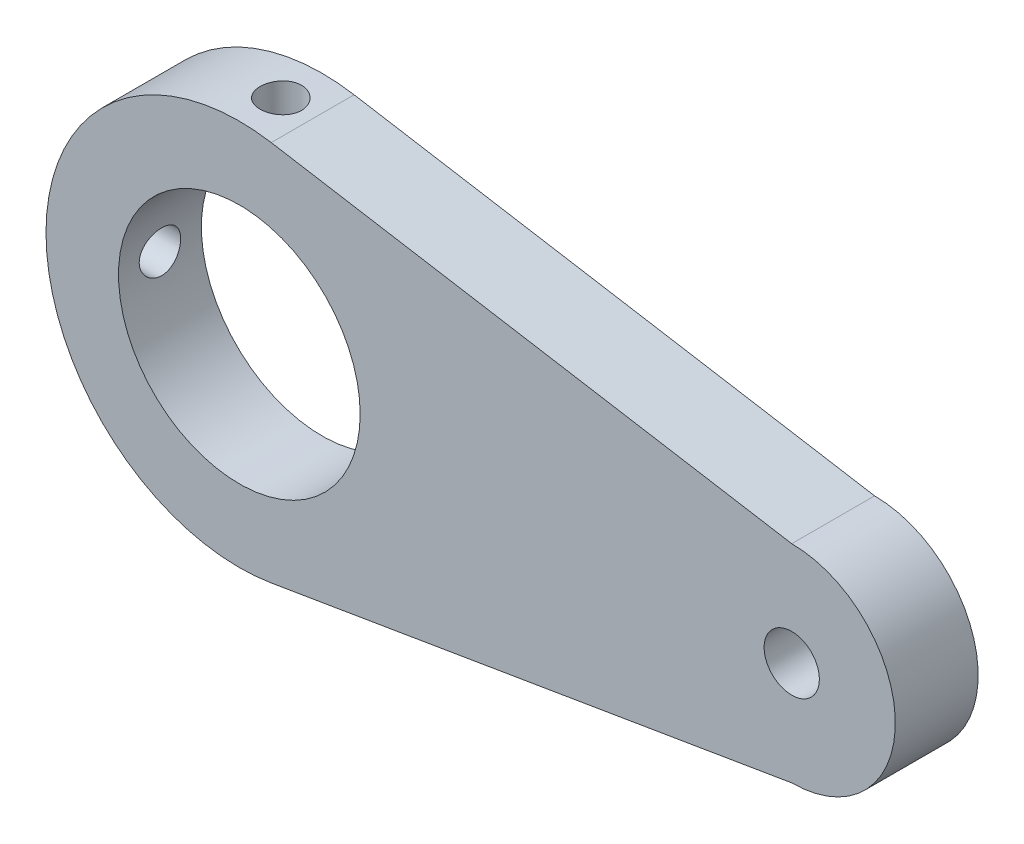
ISO-10303-21;
HEADER;
FILE_DESCRIPTION(('STEP AP214'),'2;1');
FILE_NAME('part.step','',(''),(''),'','','');
FILE_SCHEMA(('AUTOMOTIVE_DESIGN { 1 0 10303 214 1 1 1 1 }'));
ENDSEC;
DATA;
#1=APPLICATION_CONTEXT('core data for automotive mechanical design processes');
#2=APPLICATION_PROTOCOL_DEFINITION('international standard','automotive_design',2000,#1);
#3=PRODUCT_CONTEXT('',#1,'mechanical');
#4=PRODUCT('Part','Part','',(#3));
#5=PRODUCT_RELATED_PRODUCT_CATEGORY('part','',(#4));
#6=PRODUCT_DEFINITION_FORMATION('','',#4);
#7=PRODUCT_DEFINITION_CONTEXT('part definition',#1,'design');
#8=PRODUCT_DEFINITION('design','',#6,#7);
#9=PRODUCT_DEFINITION_SHAPE('','',#8);
#10=(LENGTH_UNIT() NAMED_UNIT(*) SI_UNIT(.MILLI.,.METRE.));
#11=(NAMED_UNIT(*) PLANE_ANGLE_UNIT() SI_UNIT($,.RADIAN.));
#12=(NAMED_UNIT(*) SI_UNIT($,.STERADIAN.) SOLID_ANGLE_UNIT());
#13=UNCERTAINTY_MEASURE_WITH_UNIT(LENGTH_MEASURE(1.E-05),#10,'distance_accuracy_value','');
#14=(GEOMETRIC_REPRESENTATION_CONTEXT(3) GLOBAL_UNCERTAINTY_ASSIGNED_CONTEXT((#13)) GLOBAL_UNIT_ASSIGNED_CONTEXT((#10,
#11,#12)) REPRESENTATION_CONTEXT('',''));
#15=CARTESIAN_POINT('',(0.,0.,0.));
#16=DIRECTION('',(0.,0.,1.));
#17=DIRECTION('',(1.,0.,0.));
#18=AXIS2_PLACEMENT_3D('',#15,#16,#17);
#19=CARTESIAN_POINT('',(0.,0.,12.));
#20=DIRECTION('',(0.,0.,-1.));
#21=DIRECTION('',(-1.,0.,0.));
#22=AXIS2_PLACEMENT_3D('',#19,#20,#21);
#23=CYLINDRICAL_SURFACE('',#22,28.);
#24=CARTESIAN_POINT('',(0.,28.,9.));
#25=CARTESIAN_POINT('',(-0.167994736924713,27.9999979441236,8.99999275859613));
#26=CARTESIAN_POINT('',(-0.336098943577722,27.9984720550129,8.98584135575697));
#27=CARTESIAN_POINT('',(-0.667642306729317,27.9925317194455,8.92960483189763));
#28=CARTESIAN_POINT('',(-0.831076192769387,27.9881141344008,8.88748935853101));
#29=CARTESIAN_POINT('',(-1.14843017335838,27.9768888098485,8.77656877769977));
#30=CARTESIAN_POINT('',(-1.30235611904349,27.9700825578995,8.70778027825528));
#31=CARTESIAN_POINT('',(-1.59644532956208,27.9548398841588,8.54549966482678));
#32=CARTESIAN_POINT('',(-1.73661122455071,27.9464037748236,8.45201228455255));
#33=CARTESIAN_POINT('',(-1.99980893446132,27.928806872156,8.2425765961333));
#34=CARTESIAN_POINT('',(-2.12277630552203,27.9196435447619,8.12654750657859));
#35=CARTESIAN_POINT('',(-2.34753215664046,27.9016457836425,7.87549475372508));
#36=CARTESIAN_POINT('',(-2.44931963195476,27.8928113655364,7.74047018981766));
#37=CARTESIAN_POINT('',(-2.62905806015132,27.8764461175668,7.4548514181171));
#38=CARTESIAN_POINT('',(-2.70695009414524,27.8689185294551,7.30421993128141));
#39=CARTESIAN_POINT('',(-2.83631035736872,27.8560513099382,6.99192108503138));
#40=CARTESIAN_POINT('',(-2.88777933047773,27.8507116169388,6.83025403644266));
#41=CARTESIAN_POINT('',(-2.96263998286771,27.8428480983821,6.50113406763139));
#42=CARTESIAN_POINT('',(-2.9861391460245,27.8403134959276,6.33370585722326));
#43=CARTESIAN_POINT('',(-3.00472546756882,27.8383138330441,5.99726420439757));
#44=CARTESIAN_POINT('',(-2.99981347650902,27.8388486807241,5.82825080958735));
#45=CARTESIAN_POINT('',(-2.96180541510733,27.8429176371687,5.49417951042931));
#46=CARTESIAN_POINT('',(-2.92882697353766,27.8464392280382,5.32910804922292));
#47=CARTESIAN_POINT('',(-2.8358053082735,27.85606533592,5.00685629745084));
#48=CARTESIAN_POINT('',(-2.77576167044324,27.8621698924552,4.84967612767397));
#49=CARTESIAN_POINT('',(-2.63018509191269,27.8762884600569,4.54729876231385));
#50=CARTESIAN_POINT('',(-2.54460024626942,27.8843063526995,4.40212674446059));
#51=CARTESIAN_POINT('',(-2.35040794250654,27.9013449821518,4.12816219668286));
#52=CARTESIAN_POINT('',(-2.24179971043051,27.9103657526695,3.99937021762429));
#53=CARTESIAN_POINT('',(-2.00398797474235,27.928449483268,3.76113834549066));
#54=CARTESIAN_POINT('',(-1.87468293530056,27.9375124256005,3.65179978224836));
#55=CARTESIAN_POINT('',(-1.59949986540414,27.9546163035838,3.45636478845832));
#56=CARTESIAN_POINT('',(-1.45362181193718,27.9626572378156,3.37026839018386));
#57=CARTESIAN_POINT('',(-1.14936135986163,27.9768143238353,3.22376466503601));
#58=CARTESIAN_POINT('',(-0.990976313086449,27.9829300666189,3.16336279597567));
#59=CARTESIAN_POINT('',(-0.666232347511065,27.992543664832,3.07003860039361));
#60=CARTESIAN_POINT('',(-0.499873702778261,27.9960416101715,3.03711533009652));
#61=CARTESIAN_POINT('',(-0.164782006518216,28.0000139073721,2.9998121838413));
#62=CARTESIAN_POINT('',(0.00393531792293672,28.0005030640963,2.99529254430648));
#63=CARTESIAN_POINT('',(0.339724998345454,27.998442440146,3.01455740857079));
#64=CARTESIAN_POINT('',(0.506797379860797,27.9958927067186,3.03834147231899));
#65=CARTESIAN_POINT('',(0.834148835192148,27.9880501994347,3.11342260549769));
#66=CARTESIAN_POINT('',(0.99444316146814,27.9827639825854,3.16465391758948));
#67=CARTESIAN_POINT('',(1.30416325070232,27.970041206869,3.29310749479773));
#68=CARTESIAN_POINT('',(1.45358873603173,27.9626045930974,3.370330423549));
#69=CARTESIAN_POINT('',(1.73795939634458,27.9463751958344,3.54891954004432));
#70=CARTESIAN_POINT('',(1.87284684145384,27.9375773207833,3.65037718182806));
#71=CARTESIAN_POINT('',(2.12372730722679,27.9196280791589,3.87442504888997));
#72=CARTESIAN_POINT('',(2.23971978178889,27.9104767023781,3.99701588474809));
#73=CARTESIAN_POINT('',(2.45000579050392,27.8928070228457,4.2604616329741));
#74=CARTESIAN_POINT('',(2.54420735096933,27.8842915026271,4.40139017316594));
#75=CARTESIAN_POINT('',(2.70760441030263,27.8689009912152,4.69714929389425));
#76=CARTESIAN_POINT('',(2.77680029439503,27.8620259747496,4.85197966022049));
#77=CARTESIAN_POINT('',(2.88806913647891,27.8507127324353,5.17083687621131));
#78=CARTESIAN_POINT('',(2.93019606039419,27.8462696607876,5.3348447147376));
#79=CARTESIAN_POINT('',(2.98630593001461,27.8403086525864,5.66765631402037));
#80=CARTESIAN_POINT('',(3.00028981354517,27.8387906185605,5.83645991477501));
#81=CARTESIAN_POINT('',(2.99970253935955,27.838853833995,6.17315698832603));
#82=CARTESIAN_POINT('',(2.9852758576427,27.8404194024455,6.34105073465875));
#83=CARTESIAN_POINT('',(2.92858069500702,27.8464399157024,6.67201425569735));
#84=CARTESIAN_POINT('',(2.88631218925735,27.8508948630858,6.83508402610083));
#85=CARTESIAN_POINT('',(2.77517453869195,27.862187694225,7.15176474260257));
#86=CARTESIAN_POINT('',(2.70631036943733,27.8690251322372,7.3053774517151));
#87=CARTESIAN_POINT('',(2.54395080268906,27.8843134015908,7.59888796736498));
#88=CARTESIAN_POINT('',(2.45045542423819,27.8927642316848,7.73878578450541));
#89=CARTESIAN_POINT('',(2.24094619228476,27.9103786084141,8.00163552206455));
#90=CARTESIAN_POINT('',(2.12482459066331,27.9195454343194,8.12450134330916));
#91=CARTESIAN_POINT('',(1.87357687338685,27.9375291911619,8.34906387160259));
#92=CARTESIAN_POINT('',(1.73844623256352,27.9463460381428,8.45075552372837));
#93=CARTESIAN_POINT('',(1.45258857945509,27.9626630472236,8.63031691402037));
#94=CARTESIAN_POINT('',(1.30181826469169,27.970159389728,8.70811801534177));
#95=CARTESIAN_POINT('',(0.989366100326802,27.9829502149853,8.83719300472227));
#96=CARTESIAN_POINT('',(0.82769666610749,27.9882471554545,8.88849651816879));
#97=CARTESIAN_POINT('',(0.554276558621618,27.9947255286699,8.9504612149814));
#98=CARTESIAN_POINT('',(0.444267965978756,27.9966941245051,8.96901253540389));
#99=CARTESIAN_POINT('',(0.222855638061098,27.9993320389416,8.99378429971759));
#100=CARTESIAN_POINT('',(0.111451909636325,28.0000013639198,9.00000480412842));
#101=CARTESIAN_POINT('',(0.,28.,9.));
#102=B_SPLINE_CURVE_WITH_KNOTS('',3,(#24,#25,#26,#27,#28,#29,#30,#31,#32,#33,#34,#35,#36,#37,
#38,#39,#40,#41,#42,#43,#44,#45,#46,#47,#48,#49,#50,#51,#52,#53,#54,#55,#56,#57,#58,#59,#60,#61,
#62,#63,#64,#65,#66,#67,#68,#69,#70,#71,#72,#73,#74,#75,#76,#77,#78,#79,#80,#81,#82,#83,#84,#85,
#86,#87,#88,#89,#90,#91,#92,#93,#94,#95,#96,#97,#98,#99,#100,#101),.UNSPECIFIED.,.T.,.F.,(4,2,2,
2,2,2,2,2,2,2,2,2,2,2,2,2,2,2,2,2,2,2,2,2,2,2,2,2,2,2,2,2,2,2,2,2,2,2,4),(0.,0.503577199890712,
1.0077018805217,1.5115131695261,2.01522796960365,2.52078235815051,3.02636072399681,
3.53317585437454,4.03997671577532,4.54482366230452,5.04965549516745,5.55238189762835,
6.05511599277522,6.55887878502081,7.062658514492,7.56899007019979,8.07532232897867,
8.58176208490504,9.08818444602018,9.59211292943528,10.0960335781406,10.5987523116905,
11.101483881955,11.6061434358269,12.1108175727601,12.6175844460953,13.1243435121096,
13.6300891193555,14.135817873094,14.6389814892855,15.1421455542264,15.6452155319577,
16.1482851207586,16.6538116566,17.1594587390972,17.6665452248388,18.1730635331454,
18.5071508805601,18.8412365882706),.UNSPECIFIED.);
#103=CARTESIAN_POINT('',(0.,28.,9.));
#104=VERTEX_POINT('',#103);
#105=EDGE_CURVE('E121',#104,#104,#102,.T.);
#106=ORIENTED_EDGE('',*,*,#105,.T.);
#107=EDGE_LOOP('',(#106));
#108=FACE_BOUND('',#107,.T.);
#109=CARTESIAN_POINT('',(0.,0.,0.));
#110=DIRECTION('',(0.,0.,1.));
#111=DIRECTION('',(1.,0.,0.));
#112=AXIS2_PLACEMENT_3D('',#109,#110,#111);
#113=CIRCLE('',#112,28.);
#114=CARTESIAN_POINT('',(4.62202222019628,27.6158814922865,0.));
#115=VERTEX_POINT('',#114);
#116=CARTESIAN_POINT('',(4.62202222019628,-27.6158814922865,0.));
#117=VERTEX_POINT('',#116);
#118=EDGE_CURVE('E108',#115,#117,#113,.T.);
#119=ORIENTED_EDGE('',*,*,#118,.T.);
#120=DIRECTION('',(0.,0.,-1.));
#121=VECTOR('',#120,1.);
#122=CARTESIAN_POINT('',(4.62202222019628,-27.6158814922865,12.));
#123=LINE('',#122,#121);
#124=CARTESIAN_POINT('',(4.62202222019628,-27.6158814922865,12.));
#125=VERTEX_POINT('',#124);
#126=EDGE_CURVE('E11',#125,#117,#123,.T.);
#127=ORIENTED_EDGE('',*,*,#126,.F.);
#128=CARTESIAN_POINT('',(0.,0.,12.));
#129=DIRECTION('',(0.,0.,1.));
#130=DIRECTION('',(1.,0.,0.));
#131=AXIS2_PLACEMENT_3D('',#128,#129,#130);
#132=CIRCLE('',#131,28.);
#133=CARTESIAN_POINT('',(4.62202222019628,27.6158814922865,12.));
#134=VERTEX_POINT('',#133);
#135=EDGE_CURVE('E95',#134,#125,#132,.T.);
#136=ORIENTED_EDGE('',*,*,#135,.F.);
#137=DIRECTION('',(0.,0.,-1.));
#138=VECTOR('',#137,1.);
#139=CARTESIAN_POINT('',(4.62202222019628,27.6158814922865,12.));
#140=LINE('',#139,#138);
#141=EDGE_CURVE('E104',#134,#115,#140,.T.);
#142=ORIENTED_EDGE('',*,*,#141,.T.);
#143=EDGE_LOOP('',(#119,#127,#136,#142));
#144=FACE_BOUND('',#143,.T.);
#145=CARTESIAN_POINT('',(-28.,0.,9.));
#146=CARTESIAN_POINT('',(-27.9999979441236,0.167994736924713,8.99999275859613));
#147=CARTESIAN_POINT('',(-27.9984720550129,0.336098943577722,8.98584135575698));
#148=CARTESIAN_POINT('',(-27.9925317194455,0.667642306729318,8.92960483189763));
#149=CARTESIAN_POINT('',(-27.9881141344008,0.831076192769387,8.88748935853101));
#150=CARTESIAN_POINT('',(-27.9768888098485,1.14843017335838,8.77656877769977));
#151=CARTESIAN_POINT('',(-27.9700825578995,1.30235611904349,8.70778027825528));
#152=CARTESIAN_POINT('',(-27.9548398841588,1.59644532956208,8.54549966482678));
#153=CARTESIAN_POINT('',(-27.9464037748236,1.73661122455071,8.45201228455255));
#154=CARTESIAN_POINT('',(-27.928806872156,1.99980893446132,8.2425765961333));
#155=CARTESIAN_POINT('',(-27.9196435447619,2.12277630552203,8.12654750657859));
#156=CARTESIAN_POINT('',(-27.9016457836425,2.34753215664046,7.87549475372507));
#157=CARTESIAN_POINT('',(-27.8928113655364,2.44931963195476,7.74047018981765));
#158=CARTESIAN_POINT('',(-27.8764461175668,2.62905806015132,7.4548514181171));
#159=CARTESIAN_POINT('',(-27.8689185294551,2.70695009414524,7.30421993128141));
#160=CARTESIAN_POINT('',(-27.8560513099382,2.83631035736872,6.99192108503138));
#161=CARTESIAN_POINT('',(-27.8507116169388,2.88777933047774,6.83025403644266));
#162=CARTESIAN_POINT('',(-27.8428480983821,2.96263998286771,6.50113406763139));
#163=CARTESIAN_POINT('',(-27.8403134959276,2.98613914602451,6.33370585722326));
#164=CARTESIAN_POINT('',(-27.8383138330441,3.00472546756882,5.99726420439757));
#165=CARTESIAN_POINT('',(-27.8388486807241,2.99981347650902,5.82825080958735));
#166=CARTESIAN_POINT('',(-27.8429176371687,2.96180541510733,5.49417951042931));
#167=CARTESIAN_POINT('',(-27.8464392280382,2.92882697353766,5.32910804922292));
#168=CARTESIAN_POINT('',(-27.85606533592,2.8358053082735,5.00685629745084));
#169=CARTESIAN_POINT('',(-27.8621698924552,2.77576167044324,4.84967612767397));
#170=CARTESIAN_POINT('',(-27.8762884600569,2.63018509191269,4.54729876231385));
#171=CARTESIAN_POINT('',(-27.8843063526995,2.54460024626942,4.40212674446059));
#172=CARTESIAN_POINT('',(-27.9013449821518,2.35040794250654,4.12816219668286));
#173=CARTESIAN_POINT('',(-27.9103657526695,2.24179971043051,3.99937021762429));
#174=CARTESIAN_POINT('',(-27.928449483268,2.00398797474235,3.76113834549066));
#175=CARTESIAN_POINT('',(-27.9375124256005,1.87468293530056,3.65179978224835));
#176=CARTESIAN_POINT('',(-27.9546163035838,1.59949986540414,3.45636478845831));
#177=CARTESIAN_POINT('',(-27.9626572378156,1.45362181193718,3.37026839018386));
#178=CARTESIAN_POINT('',(-27.9768143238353,1.14936135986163,3.22376466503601));
#179=CARTESIAN_POINT('',(-27.9829300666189,0.990976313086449,3.16336279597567));
#180=CARTESIAN_POINT('',(-27.992543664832,0.666232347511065,3.07003860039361));
#181=CARTESIAN_POINT('',(-27.9960416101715,0.499873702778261,3.03711533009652));
#182=CARTESIAN_POINT('',(-28.0000139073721,0.164782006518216,2.9998121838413));
#183=CARTESIAN_POINT('',(-28.0005030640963,-0.00393531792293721,2.99529254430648));
#184=CARTESIAN_POINT('',(-27.998442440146,-0.339724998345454,3.01455740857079));
#185=CARTESIAN_POINT('',(-27.9958927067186,-0.506797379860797,3.03834147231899));
#186=CARTESIAN_POINT('',(-27.9880501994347,-0.834148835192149,3.11342260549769));
#187=CARTESIAN_POINT('',(-27.9827639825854,-0.994443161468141,3.16465391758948));
#188=CARTESIAN_POINT('',(-27.970041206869,-1.30416325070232,3.29310749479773));
#189=CARTESIAN_POINT('',(-27.9626045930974,-1.45358873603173,3.370330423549));
#190=CARTESIAN_POINT('',(-27.9463751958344,-1.73795939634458,3.54891954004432));
#191=CARTESIAN_POINT('',(-27.9375773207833,-1.87284684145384,3.65037718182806));
#192=CARTESIAN_POINT('',(-27.9196280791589,-2.12372730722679,3.87442504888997));
#193=CARTESIAN_POINT('',(-27.9104767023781,-2.23971978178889,3.99701588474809));
#194=CARTESIAN_POINT('',(-27.8928070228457,-2.45000579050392,4.2604616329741));
#195=CARTESIAN_POINT('',(-27.8842915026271,-2.54420735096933,4.40139017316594));
#196=CARTESIAN_POINT('',(-27.8689009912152,-2.70760441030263,4.69714929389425));
#197=CARTESIAN_POINT('',(-27.8620259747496,-2.77680029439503,4.85197966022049));
#198=CARTESIAN_POINT('',(-27.8507127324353,-2.88806913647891,5.17083687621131));
#199=CARTESIAN_POINT('',(-27.8462696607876,-2.93019606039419,5.3348447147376));
#200=CARTESIAN_POINT('',(-27.8403086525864,-2.98630593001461,5.66765631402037));
#201=CARTESIAN_POINT('',(-27.8387906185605,-3.00028981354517,5.83645991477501));
#202=CARTESIAN_POINT('',(-27.838853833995,-2.99970253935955,6.17315698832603));
#203=CARTESIAN_POINT('',(-27.8404194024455,-2.9852758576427,6.34105073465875));
#204=CARTESIAN_POINT('',(-27.8464399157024,-2.92858069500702,6.67201425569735));
#205=CARTESIAN_POINT('',(-27.8508948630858,-2.88631218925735,6.83508402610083));
#206=CARTESIAN_POINT('',(-27.862187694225,-2.77517453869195,7.15176474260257));
#207=CARTESIAN_POINT('',(-27.8690251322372,-2.70631036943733,7.3053774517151));
#208=CARTESIAN_POINT('',(-27.8843134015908,-2.54395080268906,7.59888796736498));
#209=CARTESIAN_POINT('',(-27.8927642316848,-2.45045542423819,7.73878578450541));
#210=CARTESIAN_POINT('',(-27.9103786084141,-2.24094619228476,8.00163552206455));
#211=CARTESIAN_POINT('',(-27.9195454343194,-2.12482459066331,8.12450134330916));
#212=CARTESIAN_POINT('',(-27.9375291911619,-1.87357687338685,8.34906387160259));
#213=CARTESIAN_POINT('',(-27.9463460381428,-1.73844623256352,8.45075552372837));
#214=CARTESIAN_POINT('',(-27.9626630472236,-1.45258857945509,8.63031691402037));
#215=CARTESIAN_POINT('',(-27.970159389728,-1.30181826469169,8.70811801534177));
#216=CARTESIAN_POINT('',(-27.9829502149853,-0.989366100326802,8.83719300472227));
#217=CARTESIAN_POINT('',(-27.9882471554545,-0.82769666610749,8.88849651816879));
#218=CARTESIAN_POINT('',(-27.9947255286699,-0.554276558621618,8.9504612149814));
#219=CARTESIAN_POINT('',(-27.9966941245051,-0.444267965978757,8.96901253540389));
#220=CARTESIAN_POINT('',(-27.9993320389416,-0.222855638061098,8.99378429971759));
#221=CARTESIAN_POINT('',(-28.0000013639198,-0.111451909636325,9.00000480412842));
#222=CARTESIAN_POINT('',(-28.,0.,9.));
#223=B_SPLINE_CURVE_WITH_KNOTS('',3,(#145,#146,#147,#148,#149,#150,#151,#152,#153,#154,#155,
#156,#157,#158,#159,#160,#161,#162,#163,#164,#165,#166,#167,#168,#169,#170,#171,#172,#173,#174,
#175,#176,#177,#178,#179,#180,#181,#182,#183,#184,#185,#186,#187,#188,#189,#190,#191,#192,#193,
#194,#195,#196,#197,#198,#199,#200,#201,#202,#203,#204,#205,#206,#207,#208,#209,#210,#211,#212,
#213,#214,#215,#216,#217,#218,#219,#220,#221,#222),.UNSPECIFIED.,.T.,.F.,(4,2,2,2,2,2,2,2,2,2,2,
2,2,2,2,2,2,2,2,2,2,2,2,2,2,2,2,2,2,2,2,2,2,2,2,2,2,2,4),(0.,0.503577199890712,1.0077018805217,
1.5115131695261,2.01522796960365,2.52078235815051,3.02636072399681,3.53317585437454,
4.03997671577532,4.54482366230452,5.04965549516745,5.55238189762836,6.05511599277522,
6.55887878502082,7.062658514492,7.56899007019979,8.07532232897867,8.58176208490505,
9.08818444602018,9.59211292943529,10.0960335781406,10.5987523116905,11.101483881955,
11.6061434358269,12.1108175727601,12.6175844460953,13.1243435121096,13.6300891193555,
14.135817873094,14.6389814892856,15.1421455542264,15.6452155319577,16.1482851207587,
16.6538116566,17.1594587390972,17.6665452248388,18.1730635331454,18.5071508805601,
18.8412365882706),.UNSPECIFIED.);
#224=CARTESIAN_POINT('',(-28.,0.,9.));
#225=VERTEX_POINT('',#224);
#226=EDGE_CURVE('E122',#225,#225,#223,.T.);
#227=ORIENTED_EDGE('',*,*,#226,.F.);
#228=EDGE_LOOP('',(#227));
#229=FACE_BOUND('',#228,.T.);
#230=ADVANCED_FACE('F36',(#108,#144,#229),#23,.T.);
#231=CARTESIAN_POINT('',(0.,0.,12.));
#232=DIRECTION('',(0.,0.,-1.));
#233=DIRECTION('',(-1.,0.,0.));
#234=AXIS2_PLACEMENT_3D('',#231,#232,#233);
#235=CYLINDRICAL_SURFACE('',#234,17.5);
#236=CARTESIAN_POINT('',(0.,0.,0.));
#237=DIRECTION('',(0.,0.,1.));
#238=DIRECTION('',(1.,0.,0.));
#239=AXIS2_PLACEMENT_3D('',#236,#237,#238);
#240=CIRCLE('',#239,17.5);
#241=CARTESIAN_POINT('',(17.5,0.,0.));
#242=VERTEX_POINT('',#241);
#243=EDGE_CURVE('E147',#242,#242,#240,.T.);
#244=ORIENTED_EDGE('',*,*,#243,.F.);
#245=EDGE_LOOP('',(#244));
#246=FACE_BOUND('',#245,.T.);
#247=CARTESIAN_POINT('',(0.,0.,12.));
#248=DIRECTION('',(0.,0.,1.));
#249=DIRECTION('',(1.,0.,0.));
#250=AXIS2_PLACEMENT_3D('',#247,#248,#249);
#251=CIRCLE('',#250,17.5);
#252=CARTESIAN_POINT('',(17.5,0.,12.));
#253=VERTEX_POINT('',#252);
#254=EDGE_CURVE('E111',#253,#253,#251,.T.);
#255=ORIENTED_EDGE('',*,*,#254,.T.);
#256=EDGE_LOOP('',(#255));
#257=FACE_BOUND('',#256,.T.);
#258=CARTESIAN_POINT('',(0.,17.5,9.));
#259=CARTESIAN_POINT('',(-0.167197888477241,17.4999970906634,8.99999336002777));
#260=CARTESIAN_POINT('',(-0.33448525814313,17.4975789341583,8.9859752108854));
#261=CARTESIAN_POINT('',(-0.664363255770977,17.4881653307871,8.9302990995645));
#262=CARTESIAN_POINT('',(-0.826949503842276,17.4811657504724,8.88861617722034));
#263=CARTESIAN_POINT('',(-1.14260529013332,17.4633739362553,8.77891008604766));
#264=CARTESIAN_POINT('',(-1.29568266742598,17.4525848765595,8.7109089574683));
#265=CARTESIAN_POINT('',(-1.58823673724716,17.4283986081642,8.55055555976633));
#266=CARTESIAN_POINT('',(-1.72771488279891,17.4150016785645,8.45820589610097));
#267=CARTESIAN_POINT('',(-1.99053687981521,17.3869322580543,8.25078614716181));
#268=CARTESIAN_POINT('',(-2.11372361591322,17.3722493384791,8.13551837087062));
#269=CARTESIAN_POINT('',(-2.33910834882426,17.3433420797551,7.88595990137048));
#270=CARTESIAN_POINT('',(-2.44130498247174,17.3291177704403,7.75166797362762));
#271=CARTESIAN_POINT('',(-2.62244343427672,17.3026372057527,7.46678711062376));
#272=CARTESIAN_POINT('',(-2.70122890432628,17.2903944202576,7.31609740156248));
#273=CARTESIAN_POINT('',(-2.8323085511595,17.2694082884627,7.00337737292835));
#274=CARTESIAN_POINT('',(-2.88460462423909,17.2606646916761,6.84134786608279));
#275=CARTESIAN_POINT('',(-2.96072391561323,17.2477710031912,6.512216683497));
#276=CARTESIAN_POINT('',(-2.98481900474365,17.243577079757,6.34517963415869));
#277=CARTESIAN_POINT('',(-3.00469550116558,17.2401251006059,6.00938486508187));
#278=CARTESIAN_POINT('',(-3.00047902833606,17.2408666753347,5.8406272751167));
#279=CARTESIAN_POINT('',(-2.9640733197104,17.247161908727,5.5081288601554));
#280=CARTESIAN_POINT('',(-2.93219030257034,17.2526628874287,5.34435336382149));
#281=CARTESIAN_POINT('',(-2.84183747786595,17.2677745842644,5.02451108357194));
#282=CARTESIAN_POINT('',(-2.78336671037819,17.277385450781,4.86844457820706));
#283=CARTESIAN_POINT('',(-2.64119011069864,17.2996905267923,4.56753825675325));
#284=CARTESIAN_POINT('',(-2.55735789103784,17.3124001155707,4.42275934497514));
#285=CARTESIAN_POINT('',(-2.36692773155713,17.3394600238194,4.14920752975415));
#286=CARTESIAN_POINT('',(-2.26032785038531,17.3538104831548,4.02043599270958));
#287=CARTESIAN_POINT('',(-2.02572372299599,17.3827662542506,3.78078244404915));
#288=CARTESIAN_POINT('',(-1.89745691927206,17.3973724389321,3.67015740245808));
#289=CARTESIAN_POINT('',(-1.62404588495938,17.425020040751,3.47196054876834));
#290=CARTESIAN_POINT('',(-1.47890153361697,17.4380614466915,3.38438890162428));
#291=CARTESIAN_POINT('',(-1.17560813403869,17.4611302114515,3.23475815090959));
#292=CARTESIAN_POINT('',(-1.01744722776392,17.4711547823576,3.17272262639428));
#293=CARTESIAN_POINT('',(-0.692740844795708,17.4870382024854,3.0761681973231));
#294=CARTESIAN_POINT('',(-0.526196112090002,17.4928974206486,3.04164685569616));
#295=CARTESIAN_POINT('',(-0.191663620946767,17.4997401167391,3.00145111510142));
#296=CARTESIAN_POINT('',(-0.0237194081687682,17.5007831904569,2.99542410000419));
#297=CARTESIAN_POINT('',(0.310778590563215,17.4980396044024,3.01144674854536));
#298=CARTESIAN_POINT('',(0.477332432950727,17.4942531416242,3.03349526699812));
#299=CARTESIAN_POINT('',(0.803226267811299,17.4823128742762,3.1047498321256));
#300=CARTESIAN_POINT('',(0.962605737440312,17.474187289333,3.15378046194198));
#301=CARTESIAN_POINT('',(1.27088253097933,17.4544761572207,3.27741983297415));
#302=CARTESIAN_POINT('',(1.41977923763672,17.4428904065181,3.35203007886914));
#303=CARTESIAN_POINT('',(1.70438969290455,17.417396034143,3.52551241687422));
#304=CARTESIAN_POINT('',(1.83996793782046,17.4034668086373,3.62460372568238));
#305=CARTESIAN_POINT('',(2.09269752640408,17.374890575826,3.8439348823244));
#306=CARTESIAN_POINT('',(2.20984744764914,17.3602435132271,3.9641763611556));
#307=CARTESIAN_POINT('',(2.42370922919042,17.3316886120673,4.22397948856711));
#308=CARTESIAN_POINT('',(2.52018230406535,17.3177906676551,4.36373895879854));
#309=CARTESIAN_POINT('',(2.68828177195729,17.2924954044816,4.65768722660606));
#310=CARTESIAN_POINT('',(2.75990898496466,17.2810980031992,4.8118755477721));
#311=CARTESIAN_POINT('',(2.87593039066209,17.2621692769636,5.1296504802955));
#312=CARTESIAN_POINT('',(2.92044137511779,17.2546213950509,5.29319341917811));
#313=CARTESIAN_POINT('',(2.98133287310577,17.2442055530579,5.62557546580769));
#314=CARTESIAN_POINT('',(2.99771598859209,17.2413371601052,5.79441408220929));
#315=CARTESIAN_POINT('',(3.00181092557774,17.2406244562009,6.13020881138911));
#316=CARTESIAN_POINT('',(2.98989876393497,17.2427142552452,6.29716031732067));
#317=CARTESIAN_POINT('',(2.93855658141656,17.2515376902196,6.62664551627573));
#318=CARTESIAN_POINT('',(2.89912666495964,17.2582713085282,6.78917922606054));
#319=CARTESIAN_POINT('',(2.79401555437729,17.2755980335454,7.10505721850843));
#320=CARTESIAN_POINT('',(2.72836856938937,17.2861861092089,7.25841317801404));
#321=CARTESIAN_POINT('',(2.57272591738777,17.3100332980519,7.55199555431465));
#322=CARTESIAN_POINT('',(2.4827289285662,17.3232925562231,7.6922212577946));
#323=CARTESIAN_POINT('',(2.27960652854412,17.3511960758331,7.95745891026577));
#324=CARTESIAN_POINT('',(2.1662051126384,17.36585562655,8.08225791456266));
#325=CARTESIAN_POINT('',(1.92007371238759,17.3947877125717,8.31118326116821));
#326=CARTESIAN_POINT('',(1.78733928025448,17.4090601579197,8.41530483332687));
#327=CARTESIAN_POINT('',(1.50514767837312,17.4357318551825,8.6006229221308));
#328=CARTESIAN_POINT('',(1.35557476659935,17.4481165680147,8.68164531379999));
#329=CARTESIAN_POINT('',(1.04478686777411,17.4694759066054,8.81728768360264));
#330=CARTESIAN_POINT('',(0.883583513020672,17.4784538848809,8.8719336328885));
#331=CARTESIAN_POINT('',(0.601487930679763,17.4900568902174,8.94157686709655));
#332=CARTESIAN_POINT('',(0.482290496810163,17.4937653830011,8.96344994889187));
#333=CARTESIAN_POINT('',(0.242077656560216,17.4987379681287,8.99266378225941));
#334=CARTESIAN_POINT('',(0.121062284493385,17.5000021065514,9.00000480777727));
#335=CARTESIAN_POINT('',(0.,17.5,9.));
#336=B_SPLINE_CURVE_WITH_KNOTS('',3,(#258,#259,#260,#261,#262,#263,#264,#265,#266,#267,#268,
#269,#270,#271,#272,#273,#274,#275,#276,#277,#278,#279,#280,#281,#282,#283,#284,#285,#286,#287,
#288,#289,#290,#291,#292,#293,#294,#295,#296,#297,#298,#299,#300,#301,#302,#303,#304,#305,#306,
#307,#308,#309,#310,#311,#312,#313,#314,#315,#316,#317,#318,#319,#320,#321,#322,#323,#324,#325,
#326,#327,#328,#329,#330,#331,#332,#333,#334,#335),.UNSPECIFIED.,.T.,.F.,(4,2,2,2,2,2,2,2,2,2,2,
2,2,2,2,2,2,2,2,2,2,2,2,2,2,2,2,2,2,2,2,2,2,2,2,2,2,2,4),(0.,0.501151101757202,1.00275497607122,
1.50393968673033,2.00507078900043,2.5107284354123,3.01641891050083,3.52541434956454,
4.03437334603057,4.53838423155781,5.04235737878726,5.54082259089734,6.03930580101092,
6.54031528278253,7.04136750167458,7.54899572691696,8.05662758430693,8.56472712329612,
9.07278165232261,9.57453227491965,10.076262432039,10.5747686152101,11.0733041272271,
11.5764767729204,12.0796882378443,12.5884304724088,13.0971559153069,13.6036744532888,
14.1101461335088,14.6099250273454,15.1097020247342,15.6088290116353,16.1079830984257,
16.6133996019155,17.1189325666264,17.6281812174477,18.1369274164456,18.4998006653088,
18.8626670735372),.UNSPECIFIED.);
#337=CARTESIAN_POINT('',(0.,17.5,9.));
#338=VERTEX_POINT('',#337);
#339=EDGE_CURVE('E116',#338,#338,#336,.T.);
#340=ORIENTED_EDGE('',*,*,#339,.F.);
#341=EDGE_LOOP('',(#340));
#342=FACE_BOUND('',#341,.T.);
#343=CARTESIAN_POINT('',(-17.5,0.,9.));
#344=CARTESIAN_POINT('',(-17.4999970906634,0.167197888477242,8.99999336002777));
#345=CARTESIAN_POINT('',(-17.4975789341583,0.334485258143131,8.9859752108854));
#346=CARTESIAN_POINT('',(-17.4881653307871,0.664363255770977,8.9302990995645));
#347=CARTESIAN_POINT('',(-17.4811657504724,0.826949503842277,8.88861617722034));
#348=CARTESIAN_POINT('',(-17.4633739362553,1.14260529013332,8.77891008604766));
#349=CARTESIAN_POINT('',(-17.4525848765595,1.29568266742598,8.7109089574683));
#350=CARTESIAN_POINT('',(-17.4283986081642,1.58823673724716,8.55055555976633));
#351=CARTESIAN_POINT('',(-17.4150016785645,1.72771488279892,8.45820589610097));
#352=CARTESIAN_POINT('',(-17.3869322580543,1.99053687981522,8.25078614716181));
#353=CARTESIAN_POINT('',(-17.3722493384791,2.11372361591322,8.13551837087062));
#354=CARTESIAN_POINT('',(-17.3433420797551,2.33910834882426,7.88595990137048));
#355=CARTESIAN_POINT('',(-17.3291177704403,2.44130498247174,7.75166797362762));
#356=CARTESIAN_POINT('',(-17.3026372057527,2.62244343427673,7.46678711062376));
#357=CARTESIAN_POINT('',(-17.2903944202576,2.70122890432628,7.31609740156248));
#358=CARTESIAN_POINT('',(-17.2694082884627,2.8323085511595,7.00337737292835));
#359=CARTESIAN_POINT('',(-17.2606646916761,2.88460462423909,6.84134786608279));
#360=CARTESIAN_POINT('',(-17.2477710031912,2.96072391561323,6.512216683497));
#361=CARTESIAN_POINT('',(-17.243577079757,2.98481900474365,6.34517963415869));
#362=CARTESIAN_POINT('',(-17.2401251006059,3.00469550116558,6.00938486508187));
#363=CARTESIAN_POINT('',(-17.2408666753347,3.00047902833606,5.84062727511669));
#364=CARTESIAN_POINT('',(-17.247161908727,2.9640733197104,5.5081288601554));
#365=CARTESIAN_POINT('',(-17.2526628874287,2.93219030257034,5.34435336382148));
#366=CARTESIAN_POINT('',(-17.2677745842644,2.84183747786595,5.02451108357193));
#367=CARTESIAN_POINT('',(-17.277385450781,2.78336671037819,4.86844457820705));
#368=CARTESIAN_POINT('',(-17.2996905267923,2.64119011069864,4.56753825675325));
#369=CARTESIAN_POINT('',(-17.3124001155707,2.55735789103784,4.42275934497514));
#370=CARTESIAN_POINT('',(-17.3394600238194,2.36692773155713,4.14920752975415));
#371=CARTESIAN_POINT('',(-17.3538104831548,2.26032785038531,4.02043599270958));
#372=CARTESIAN_POINT('',(-17.3827662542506,2.02572372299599,3.78078244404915));
#373=CARTESIAN_POINT('',(-17.3973724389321,1.89745691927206,3.67015740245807));
#374=CARTESIAN_POINT('',(-17.425020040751,1.62404588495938,3.47196054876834));
#375=CARTESIAN_POINT('',(-17.4380614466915,1.47890153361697,3.38438890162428));
#376=CARTESIAN_POINT('',(-17.4611302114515,1.17560813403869,3.23475815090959));
#377=CARTESIAN_POINT('',(-17.4711547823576,1.01744722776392,3.17272262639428));
#378=CARTESIAN_POINT('',(-17.4870382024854,0.692740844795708,3.0761681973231));
#379=CARTESIAN_POINT('',(-17.4928974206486,0.526196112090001,3.04164685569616));
#380=CARTESIAN_POINT('',(-17.4997401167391,0.191663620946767,3.00145111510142));
#381=CARTESIAN_POINT('',(-17.5007831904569,0.0237194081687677,2.99542410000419));
#382=CARTESIAN_POINT('',(-17.4980396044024,-0.310778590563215,3.01144674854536));
#383=CARTESIAN_POINT('',(-17.4942531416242,-0.477332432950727,3.03349526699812));
#384=CARTESIAN_POINT('',(-17.4823128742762,-0.803226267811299,3.1047498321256));
#385=CARTESIAN_POINT('',(-17.474187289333,-0.962605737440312,3.15378046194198));
#386=CARTESIAN_POINT('',(-17.4544761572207,-1.27088253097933,3.27741983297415));
#387=CARTESIAN_POINT('',(-17.4428904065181,-1.41977923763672,3.35203007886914));
#388=CARTESIAN_POINT('',(-17.417396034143,-1.70438969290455,3.52551241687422));
#389=CARTESIAN_POINT('',(-17.4034668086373,-1.83996793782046,3.62460372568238));
#390=CARTESIAN_POINT('',(-17.374890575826,-2.09269752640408,3.8439348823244));
#391=CARTESIAN_POINT('',(-17.3602435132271,-2.20984744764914,3.9641763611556));
#392=CARTESIAN_POINT('',(-17.3316886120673,-2.42370922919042,4.22397948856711));
#393=CARTESIAN_POINT('',(-17.3177906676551,-2.52018230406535,4.36373895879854));
#394=CARTESIAN_POINT('',(-17.2924954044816,-2.68828177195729,4.65768722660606));
#395=CARTESIAN_POINT('',(-17.2810980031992,-2.75990898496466,4.8118755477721));
#396=CARTESIAN_POINT('',(-17.2621692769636,-2.87593039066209,5.1296504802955));
#397=CARTESIAN_POINT('',(-17.2546213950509,-2.9204413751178,5.29319341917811));
#398=CARTESIAN_POINT('',(-17.2442055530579,-2.98133287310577,5.62557546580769));
#399=CARTESIAN_POINT('',(-17.2413371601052,-2.99771598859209,5.79441408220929));
#400=CARTESIAN_POINT('',(-17.2406244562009,-3.00181092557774,6.13020881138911));
#401=CARTESIAN_POINT('',(-17.2427142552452,-2.98989876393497,6.29716031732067));
#402=CARTESIAN_POINT('',(-17.2515376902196,-2.93855658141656,6.62664551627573));
#403=CARTESIAN_POINT('',(-17.2582713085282,-2.89912666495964,6.78917922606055));
#404=CARTESIAN_POINT('',(-17.2755980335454,-2.79401555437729,7.10505721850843));
#405=CARTESIAN_POINT('',(-17.2861861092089,-2.72836856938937,7.25841317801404));
#406=CARTESIAN_POINT('',(-17.3100332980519,-2.57272591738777,7.55199555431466));
#407=CARTESIAN_POINT('',(-17.3232925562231,-2.4827289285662,7.6922212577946));
#408=CARTESIAN_POINT('',(-17.3511960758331,-2.27960652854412,7.95745891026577));
#409=CARTESIAN_POINT('',(-17.36585562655,-2.16620511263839,8.08225791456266));
#410=CARTESIAN_POINT('',(-17.3947877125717,-1.92007371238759,8.31118326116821));
#411=CARTESIAN_POINT('',(-17.4090601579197,-1.78733928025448,8.41530483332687));
#412=CARTESIAN_POINT('',(-17.4357318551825,-1.50514767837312,8.60062292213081));
#413=CARTESIAN_POINT('',(-17.4481165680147,-1.35557476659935,8.68164531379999));
#414=CARTESIAN_POINT('',(-17.4694759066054,-1.0447868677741,8.81728768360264));
#415=CARTESIAN_POINT('',(-17.4784538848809,-0.883583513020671,8.8719336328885));
#416=CARTESIAN_POINT('',(-17.4900568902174,-0.601487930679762,8.94157686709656));
#417=CARTESIAN_POINT('',(-17.4937653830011,-0.482290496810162,8.96344994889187));
#418=CARTESIAN_POINT('',(-17.4987379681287,-0.242077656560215,8.99266378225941));
#419=CARTESIAN_POINT('',(-17.5000021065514,-0.121062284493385,9.00000480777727));
#420=CARTESIAN_POINT('',(-17.5,0.,9.));
#421=B_SPLINE_CURVE_WITH_KNOTS('',3,(#343,#344,#345,#346,#347,#348,#349,#350,#351,#352,#353,
#354,#355,#356,#357,#358,#359,#360,#361,#362,#363,#364,#365,#366,#367,#368,#369,#370,#371,#372,
#373,#374,#375,#376,#377,#378,#379,#380,#381,#382,#383,#384,#385,#386,#387,#388,#389,#390,#391,
#392,#393,#394,#395,#396,#397,#398,#399,#400,#401,#402,#403,#404,#405,#406,#407,#408,#409,#410,
#411,#412,#413,#414,#415,#416,#417,#418,#419,#420),.UNSPECIFIED.,.T.,.F.,(4,2,2,2,2,2,2,2,2,2,2,
2,2,2,2,2,2,2,2,2,2,2,2,2,2,2,2,2,2,2,2,2,2,2,2,2,2,2,4),(0.,0.501151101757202,1.00275497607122,
1.50393968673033,2.00507078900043,2.5107284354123,3.01641891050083,3.52541434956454,
4.03437334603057,4.53838423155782,5.04235737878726,5.54082259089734,6.03930580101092,
6.54031528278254,7.04136750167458,7.54899572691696,8.05662758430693,8.56472712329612,
9.07278165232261,9.57453227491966,10.076262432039,10.5747686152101,11.0733041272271,
11.5764767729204,12.0796882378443,12.5884304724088,13.0971559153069,13.6036744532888,
14.1101461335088,14.6099250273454,15.1097020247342,15.6088290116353,16.1079830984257,
16.6133996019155,17.1189325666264,17.6281812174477,18.1369274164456,18.4998006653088,
18.8626670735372),.UNSPECIFIED.);
#422=CARTESIAN_POINT('',(-17.5,0.,9.));
#423=VERTEX_POINT('',#422);
#424=EDGE_CURVE('E40',#423,#423,#421,.T.);
#425=ORIENTED_EDGE('',*,*,#424,.T.);
#426=EDGE_LOOP('',(#425));
#427=FACE_BOUND('',#426,.T.);
#428=ADVANCED_FACE('F123',(#246,#257,#342,#427),#235,.F.);
#429=CARTESIAN_POINT('',(0.,0.,12.));
#430=DIRECTION('',(0.,0.,1.));
#431=DIRECTION('',(1.,0.,0.));
#432=AXIS2_PLACEMENT_3D('',#429,#430,#431);
#433=PLANE('',#432);
#434=ORIENTED_EDGE('',*,*,#254,.F.);
#435=EDGE_LOOP('',(#434));
#436=FACE_BOUND('',#435,.T.);
#437=ORIENTED_EDGE('',*,*,#135,.T.);
#438=DIRECTION('',(0.986281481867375,0.165072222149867,0.));
#439=VECTOR('',#438,1.);
#440=CARTESIAN_POINT('',(4.62202222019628,-27.6158814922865,12.));
#441=LINE('',#440,#439);
#442=CARTESIAN_POINT('',(80.,-15.,12.));
#443=VERTEX_POINT('',#442);
#444=EDGE_CURVE('E89',#125,#443,#441,.T.);
#445=ORIENTED_EDGE('',*,*,#444,.T.);
#446=CARTESIAN_POINT('',(80.,0.,12.));
#447=DIRECTION('',(0.,0.,1.));
#448=DIRECTION('',(1.,0.,0.));
#449=AXIS2_PLACEMENT_3D('',#446,#447,#448);
#450=CIRCLE('',#449,15.);
#451=CARTESIAN_POINT('',(80.,15.,12.));
#452=VERTEX_POINT('',#451);
#453=EDGE_CURVE('E93',#443,#452,#450,.T.);
#454=ORIENTED_EDGE('',*,*,#453,.T.);
#455=DIRECTION('',(-0.986281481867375,0.165072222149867,0.));
#456=VECTOR('',#455,1.);
#457=CARTESIAN_POINT('',(4.62202222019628,27.6158814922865,12.));
#458=LINE('',#457,#456);
#459=EDGE_CURVE('E59',#452,#134,#458,.T.);
#460=ORIENTED_EDGE('',*,*,#459,.T.);
#461=EDGE_LOOP('',(#437,#445,#454,#460));
#462=FACE_BOUND('',#461,.T.);
#463=CARTESIAN_POINT('',(80.,0.,12.));
#464=DIRECTION('',(0.,0.,1.));
#465=DIRECTION('',(1.,0.,0.));
#466=AXIS2_PLACEMENT_3D('',#463,#464,#465);
#467=CIRCLE('',#466,4.00000000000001);
#468=CARTESIAN_POINT('',(84.,0.,12.));
#469=VERTEX_POINT('',#468);
#470=EDGE_CURVE('E144',#469,#469,#467,.T.);
#471=ORIENTED_EDGE('',*,*,#470,.F.);
#472=EDGE_LOOP('',(#471));
#473=FACE_BOUND('',#472,.T.);
#474=ADVANCED_FACE('F90',(#436,#462,#473),#433,.T.);
#475=CARTESIAN_POINT('',(0.,0.,0.));
#476=DIRECTION('',(0.,0.,1.));
#477=DIRECTION('',(1.,0.,0.));
#478=AXIS2_PLACEMENT_3D('',#475,#476,#477);
#479=PLANE('',#478);
#480=ORIENTED_EDGE('',*,*,#118,.F.);
#481=DIRECTION('',(-0.986281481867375,0.165072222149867,0.));
#482=VECTOR('',#481,1.);
#483=CARTESIAN_POINT('',(4.62202222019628,27.6158814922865,0.));
#484=LINE('',#483,#482);
#485=CARTESIAN_POINT('',(80.,15.,0.));
#486=VERTEX_POINT('',#485);
#487=EDGE_CURVE('E82',#486,#115,#484,.T.);
#488=ORIENTED_EDGE('',*,*,#487,.F.);
#489=CARTESIAN_POINT('',(80.,0.,0.));
#490=DIRECTION('',(0.,0.,1.));
#491=DIRECTION('',(1.,0.,0.));
#492=AXIS2_PLACEMENT_3D('',#489,#490,#491);
#493=CIRCLE('',#492,15.);
#494=CARTESIAN_POINT('',(80.,-15.,0.));
#495=VERTEX_POINT('',#494);
#496=EDGE_CURVE('E76',#495,#486,#493,.T.);
#497=ORIENTED_EDGE('',*,*,#496,.F.);
#498=DIRECTION('',(0.986281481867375,0.165072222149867,0.));
#499=VECTOR('',#498,1.);
#500=CARTESIAN_POINT('',(4.62202222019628,-27.6158814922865,0.));
#501=LINE('',#500,#499);
#502=EDGE_CURVE('E99',#117,#495,#501,.T.);
#503=ORIENTED_EDGE('',*,*,#502,.F.);
#504=EDGE_LOOP('',(#480,#488,#497,#503));
#505=FACE_BOUND('',#504,.T.);
#506=ORIENTED_EDGE('',*,*,#243,.T.);
#507=EDGE_LOOP('',(#506));
#508=FACE_BOUND('',#507,.T.);
#509=CARTESIAN_POINT('',(80.,0.,0.));
#510=DIRECTION('',(0.,0.,1.));
#511=DIRECTION('',(1.,0.,0.));
#512=AXIS2_PLACEMENT_3D('',#509,#510,#511);
#513=CIRCLE('',#512,4.00000000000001);
#514=CARTESIAN_POINT('',(84.,0.,0.));
#515=VERTEX_POINT('',#514);
#516=EDGE_CURVE('E141',#515,#515,#513,.T.);
#517=ORIENTED_EDGE('',*,*,#516,.T.);
#518=EDGE_LOOP('',(#517));
#519=FACE_BOUND('',#518,.T.);
#520=ADVANCED_FACE('F155',(#505,#508,#519),#479,.F.);
#521=CARTESIAN_POINT('',(4.62202222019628,-27.6158814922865,12.));
#522=DIRECTION('',(-0.165072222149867,0.986281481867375,0.));
#523=DIRECTION('',(-0.986281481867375,-0.165072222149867,0.));
#524=AXIS2_PLACEMENT_3D('',#521,#522,#523);
#525=PLANE('',#524);
#526=ORIENTED_EDGE('',*,*,#502,.T.);
#527=DIRECTION('',(0.,0.,-1.));
#528=VECTOR('',#527,1.);
#529=CARTESIAN_POINT('',(80.,-15.,12.));
#530=LINE('',#529,#528);
#531=EDGE_CURVE('E50',#443,#495,#530,.T.);
#532=ORIENTED_EDGE('',*,*,#531,.F.);
#533=ORIENTED_EDGE('',*,*,#444,.F.);
#534=ORIENTED_EDGE('',*,*,#126,.T.);
#535=EDGE_LOOP('',(#526,#532,#533,#534));
#536=FACE_BOUND('',#535,.T.);
#537=ADVANCED_FACE('F98',(#536),#525,.F.);
#538=CARTESIAN_POINT('',(80.,0.,12.));
#539=DIRECTION('',(0.,0.,-1.));
#540=DIRECTION('',(-1.,0.,0.));
#541=AXIS2_PLACEMENT_3D('',#538,#539,#540);
#542=CYLINDRICAL_SURFACE('',#541,15.);
#543=ORIENTED_EDGE('',*,*,#496,.T.);
#544=DIRECTION('',(0.,0.,-1.));
#545=VECTOR('',#544,1.);
#546=CARTESIAN_POINT('',(80.,15.,12.));
#547=LINE('',#546,#545);
#548=EDGE_CURVE('E100',#452,#486,#547,.T.);
#549=ORIENTED_EDGE('',*,*,#548,.F.);
#550=ORIENTED_EDGE('',*,*,#453,.F.);
#551=ORIENTED_EDGE('',*,*,#531,.T.);
#552=EDGE_LOOP('',(#543,#549,#550,#551));
#553=FACE_BOUND('',#552,.T.);
#554=ADVANCED_FACE('F102',(#553),#542,.T.);
#555=CARTESIAN_POINT('',(4.62202222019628,27.6158814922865,12.));
#556=DIRECTION('',(-0.165072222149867,-0.986281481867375,0.));
#557=DIRECTION('',(0.986281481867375,-0.165072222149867,0.));
#558=AXIS2_PLACEMENT_3D('',#555,#556,#557);
#559=PLANE('',#558);
#560=ORIENTED_EDGE('',*,*,#487,.T.);
#561=ORIENTED_EDGE('',*,*,#141,.F.);
#562=ORIENTED_EDGE('',*,*,#459,.F.);
#563=ORIENTED_EDGE('',*,*,#548,.T.);
#564=EDGE_LOOP('',(#560,#561,#562,#563));
#565=FACE_BOUND('',#564,.T.);
#566=ADVANCED_FACE('F187',(#565),#559,.F.);
#567=CARTESIAN_POINT('',(80.,0.,12.));
#568=DIRECTION('',(0.,0.,-1.));
#569=DIRECTION('',(-1.,0.,0.));
#570=AXIS2_PLACEMENT_3D('',#567,#568,#569);
#571=CYLINDRICAL_SURFACE('',#570,4.00000000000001);
#572=ORIENTED_EDGE('',*,*,#470,.T.);
#573=EDGE_LOOP('',(#572));
#574=FACE_BOUND('',#573,.T.);
#575=ORIENTED_EDGE('',*,*,#516,.F.);
#576=EDGE_LOOP('',(#575));
#577=FACE_BOUND('',#576,.T.);
#578=ADVANCED_FACE('F131',(#574,#577),#571,.F.);
#579=CARTESIAN_POINT('',(0.,16.,6.));
#580=DIRECTION('',(0.,1.,0.));
#581=DIRECTION('',(0.,0.,1.));
#582=AXIS2_PLACEMENT_3D('',#579,#580,#581);
#583=CYLINDRICAL_SURFACE('',#582,3.);
#584=ORIENTED_EDGE('',*,*,#339,.T.);
#585=EDGE_LOOP('',(#584));
#586=FACE_BOUND('',#585,.T.);
#587=ORIENTED_EDGE('',*,*,#105,.F.);
#588=EDGE_LOOP('',(#587));
#589=FACE_BOUND('',#588,.T.);
#590=ADVANCED_FACE('F127',(#586,#589),#583,.F.);
#591=CARTESIAN_POINT('',(-12.,0.,6.));
#592=DIRECTION('',(-1.,0.,0.));
#593=DIRECTION('',(0.,0.,1.));
#594=AXIS2_PLACEMENT_3D('',#591,#592,#593);
#595=CYLINDRICAL_SURFACE('',#594,3.);
#596=ORIENTED_EDGE('',*,*,#424,.F.);
#597=EDGE_LOOP('',(#596));
#598=FACE_BOUND('',#597,.T.);
#599=ORIENTED_EDGE('',*,*,#226,.T.);
#600=EDGE_LOOP('',(#599));
#601=FACE_BOUND('',#600,.T.);
#602=ADVANCED_FACE('F130',(#598,#601),#595,.F.);
#603=CLOSED_SHELL('',(#230,#428,#474,#520,#537,#554,#566,#578,#590,#602));
#604=MANIFOLD_SOLID_BREP('B2',#603);
#605=ADVANCED_BREP_SHAPE_REPRESENTATION('',(#18,#604),#14);
#606=SHAPE_DEFINITION_REPRESENTATION(#9,#605);
ENDSEC;
END-ISO-10303-21;
